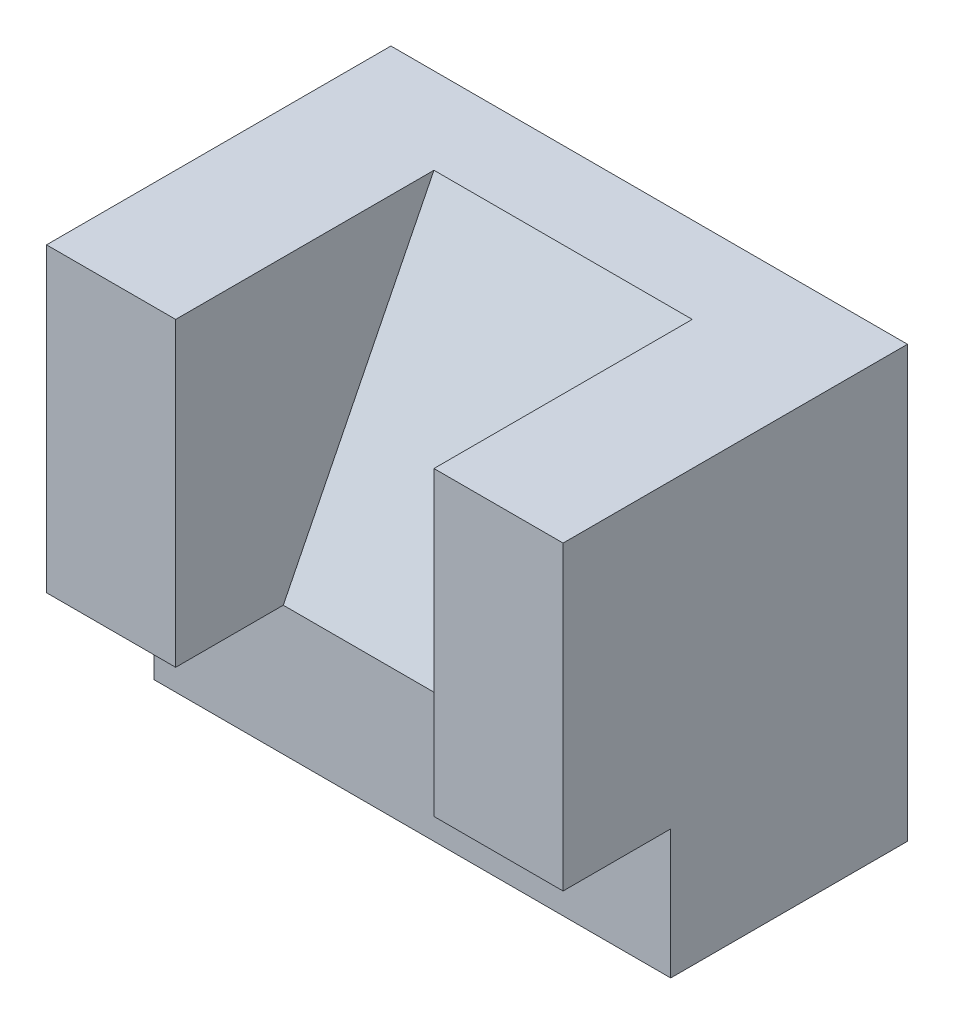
from build123d import *

# Parameters (mm, degrees)
SKETCH_1_W          = 120
SKETCH_1_H          = 55
EXTRUDE_1_DEPTH     = 30
SKETCH_1_3_W        = 120
SKETCH_1_3_H        = 80
EXTRUDE_2_DEPTH     = 70
CUT_EXTRUDE_1_DEPTH = 30


with BuildPart() as part:
    # Sketch 1 → Extrude 1 (new body)
    with BuildSketch(Plane(origin=(0, 0, 0), x_dir=(1, 0, 0), z_dir=(0, 1, 0))):
        with Locations((0, -27.5)):
            Rectangle(SKETCH_1_W, SKETCH_1_H)
    extrude(amount=-EXTRUDE_1_DEPTH)

    # Sketch 1_3 → Extrude 2 (add)
    with BuildSketch(Plane(origin=(0, 0, 0), x_dir=(1, 0, 0), z_dir=(0, 1, 0))):
        with Locations((0, -40)):
            Rectangle(SKETCH_1_3_W, SKETCH_1_3_H)
    extrude(amount=EXTRUDE_2_DEPTH)

    # Sketch 2 → Cut-Extrude 1 (cut, symmetric)
    with BuildSketch(Plane(origin=(0, 0, 0), x_dir=(0, 0, -1), z_dir=(1, 0, 0))):
        Polygon((-55, 0), (-20, 70), (-80, 70), (-80, 0), align=None)
    extrude(amount=CUT_EXTRUDE_1_DEPTH, both=True, mode=Mode.SUBTRACT)


solid = part.part
